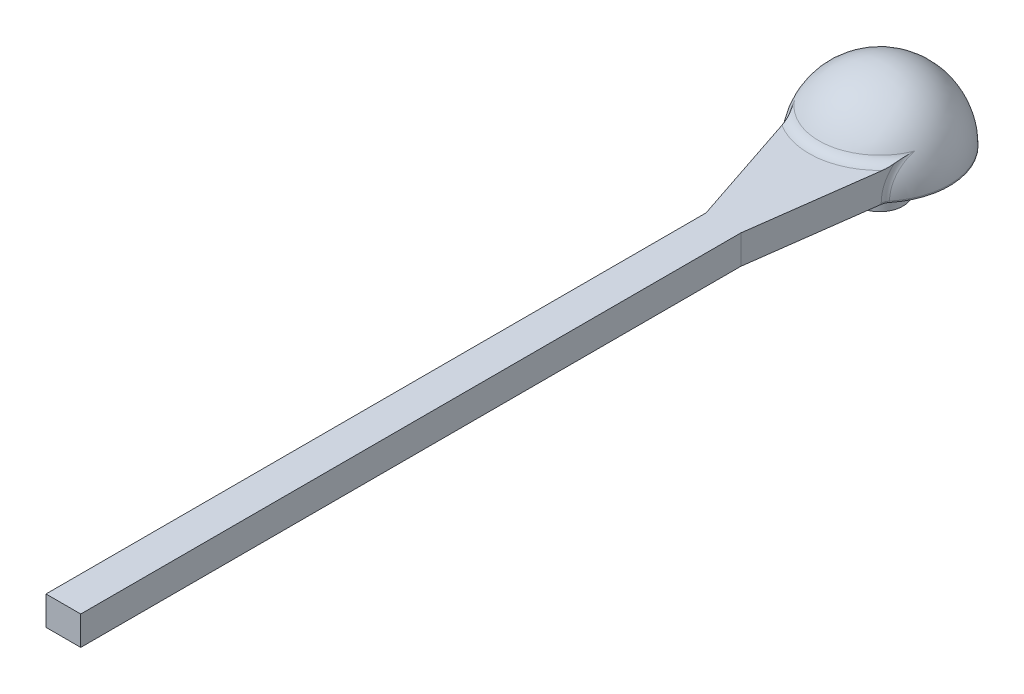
ISO-10303-21;
HEADER;
FILE_DESCRIPTION(('STEP AP214'),'2;1');
FILE_NAME('part.step','',(''),(''),'','','');
FILE_SCHEMA(('AUTOMOTIVE_DESIGN { 1 0 10303 214 1 1 1 1 }'));
ENDSEC;
DATA;
#1=APPLICATION_CONTEXT('core data for automotive mechanical design processes');
#2=APPLICATION_PROTOCOL_DEFINITION('international standard','automotive_design',2000,#1);
#3=PRODUCT_CONTEXT('',#1,'mechanical');
#4=PRODUCT('Part','Part','',(#3));
#5=PRODUCT_RELATED_PRODUCT_CATEGORY('part','',(#4));
#6=PRODUCT_DEFINITION_FORMATION('','',#4);
#7=PRODUCT_DEFINITION_CONTEXT('part definition',#1,'design');
#8=PRODUCT_DEFINITION('design','',#6,#7);
#9=PRODUCT_DEFINITION_SHAPE('','',#8);
#10=(LENGTH_UNIT() NAMED_UNIT(*) SI_UNIT(.MILLI.,.METRE.));
#11=(NAMED_UNIT(*) PLANE_ANGLE_UNIT() SI_UNIT($,.RADIAN.));
#12=(NAMED_UNIT(*) SI_UNIT($,.STERADIAN.) SOLID_ANGLE_UNIT());
#13=UNCERTAINTY_MEASURE_WITH_UNIT(LENGTH_MEASURE(1.E-05),#10,'distance_accuracy_value','');
#14=(GEOMETRIC_REPRESENTATION_CONTEXT(3) GLOBAL_UNCERTAINTY_ASSIGNED_CONTEXT((#13)) GLOBAL_UNIT_ASSIGNED_CONTEXT((#10,
#11,#12)) REPRESENTATION_CONTEXT('',''));
#15=CARTESIAN_POINT('',(0.,0.,0.));
#16=DIRECTION('',(0.,0.,1.));
#17=DIRECTION('',(1.,0.,0.));
#18=AXIS2_PLACEMENT_3D('',#15,#16,#17);
#19=CARTESIAN_POINT('',(0.,3.6,0.));
#20=DIRECTION('',(0.,-1.,0.));
#21=DIRECTION('',(0.,0.,-1.));
#22=AXIS2_PLACEMENT_3D('',#19,#20,#21);
#23=CYLINDRICAL_SURFACE('',#22,6.);
#24=CARTESIAN_POINT('',(0.,3.5,0.));
#25=DIRECTION('',(0.,1.,0.));
#26=DIRECTION('',(0.,0.,1.));
#27=AXIS2_PLACEMENT_3D('',#24,#25,#26);
#28=CIRCLE('',#27,6.);
#29=CARTESIAN_POINT('',(4.64387353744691,3.5,3.79926816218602));
#30=VERTEX_POINT('',#29);
#31=CARTESIAN_POINT('',(-3.58564445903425,3.5,4.81073318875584));
#32=VERTEX_POINT('',#31);
#33=EDGE_CURVE('E217',#30,#32,#28,.T.);
#34=ORIENTED_EDGE('',*,*,#33,.T.);
#35=DIRECTION('',(0.,-1.,0.));
#36=VECTOR('',#35,1.);
#37=CARTESIAN_POINT('',(-3.58564445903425,3.6,4.81073318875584));
#38=LINE('',#37,#36);
#39=CARTESIAN_POINT('',(-3.58564445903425,3.6,4.81073318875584));
#40=VERTEX_POINT('',#39);
#41=EDGE_CURVE('E236',#32,#40,#38,.F.);
#42=ORIENTED_EDGE('',*,*,#41,.T.);
#43=CARTESIAN_POINT('',(0.,3.6,0.));
#44=DIRECTION('',(0.,1.,0.));
#45=DIRECTION('',(0.,0.,1.));
#46=AXIS2_PLACEMENT_3D('',#43,#44,#45);
#47=CIRCLE('',#46,6.);
#48=CARTESIAN_POINT('',(4.64387353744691,3.6,3.79926816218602));
#49=VERTEX_POINT('',#48);
#50=EDGE_CURVE('E220',#49,#40,#47,.T.);
#51=ORIENTED_EDGE('',*,*,#50,.F.);
#52=DIRECTION('',(0.,-1.,0.));
#53=VECTOR('',#52,1.);
#54=CARTESIAN_POINT('',(4.64387353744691,3.6,3.79926816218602));
#55=LINE('',#54,#53);
#56=EDGE_CURVE('E234',#49,#30,#55,.T.);
#57=ORIENTED_EDGE('',*,*,#56,.T.);
#58=EDGE_LOOP('',(#34,#42,#51,#57));
#59=FACE_BOUND('',#58,.T.);
#60=ADVANCED_FACE('F35',(#59),#23,.T.);
#61=CARTESIAN_POINT('',(0.,3.6,0.));
#62=DIRECTION('',(0.,0.,1.));
#63=DIRECTION('',(1.,0.,0.));
#64=AXIS2_PLACEMENT_3D('',#61,#62,#63);
#65=SPHERICAL_SURFACE('',#64,6.);
#66=ORIENTED_EDGE('',*,*,#50,.T.);
#67=CARTESIAN_POINT('',(-4.67029996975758,3.6,1.55676665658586));
#68=DIRECTION('',(0.948683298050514,0.,-0.316227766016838));
#69=DIRECTION('',(-0.316227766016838,0.,-0.948683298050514));
#70=AXIS2_PLACEMENT_3D('',#67,#68,#69);
#71=CIRCLE('',#70,3.4299818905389);
#72=CARTESIAN_POINT('',(-4.09831093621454,6.51428571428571,3.27273375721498));
#73=VERTEX_POINT('',#72);
#74=EDGE_CURVE('E245',#40,#73,#71,.F.);
#75=ORIENTED_EDGE('',*,*,#74,.T.);
#76=CARTESIAN_POINT('',(0.,6.51428571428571,0.));
#77=DIRECTION('',(0.,-1.,0.));
#78=DIRECTION('',(0.,0.,-1.));
#79=AXIS2_PLACEMENT_3D('',#76,#77,#78);
#80=CIRCLE('',#79,5.24470578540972);
#81=CARTESIAN_POINT('',(4.90170409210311,6.51428571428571,1.86553900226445));
#82=VERTEX_POINT('',#81);
#83=EDGE_CURVE('E241',#73,#82,#80,.F.);
#84=ORIENTED_EDGE('',*,*,#83,.T.);
#85=CARTESIAN_POINT('',(5.0604785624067,3.6,0.674730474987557));
#86=DIRECTION('',(-0.991227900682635,0.,-0.132163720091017));
#87=DIRECTION('',(-0.132163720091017,0.,0.991227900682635));
#88=AXIS2_PLACEMENT_3D('',#85,#86,#87);
#89=CIRCLE('',#88,3.15218900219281);
#90=EDGE_CURVE('E243',#82,#49,#89,.F.);
#91=ORIENTED_EDGE('',*,*,#90,.T.);
#92=EDGE_LOOP('',(#66,#75,#84,#91));
#93=FACE_BOUND('',#92,.T.);
#94=ADVANCED_FACE('F304',(#93),#65,.T.);
#95=CARTESIAN_POINT('',(0.,3.5,0.));
#96=DIRECTION('',(0.,-1.,0.));
#97=DIRECTION('',(0.,0.,-1.));
#98=AXIS2_PLACEMENT_3D('',#95,#96,#97);
#99=CYLINDRICAL_SURFACE('',#98,2.);
#100=CARTESIAN_POINT('',(0.,3.5,0.));
#101=DIRECTION('',(0.,1.,0.));
#102=DIRECTION('',(0.,0.,1.));
#103=AXIS2_PLACEMENT_3D('',#100,#101,#102);
#104=CIRCLE('',#103,2.);
#105=CARTESIAN_POINT('',(0.,3.5,2.));
#106=VERTEX_POINT('',#105);
#107=EDGE_CURVE('E221',#106,#106,#104,.T.);
#108=ORIENTED_EDGE('',*,*,#107,.F.);
#109=EDGE_LOOP('',(#108));
#110=FACE_BOUND('',#109,.T.);
#111=CARTESIAN_POINT('',(0.,0.,0.));
#112=DIRECTION('',(0.,1.,0.));
#113=DIRECTION('',(0.,0.,1.));
#114=AXIS2_PLACEMENT_3D('',#111,#112,#113);
#115=CIRCLE('',#114,2.);
#116=CARTESIAN_POINT('',(0.,0.,2.));
#117=VERTEX_POINT('',#116);
#118=EDGE_CURVE('E225',#117,#117,#115,.T.);
#119=ORIENTED_EDGE('',*,*,#118,.T.);
#120=EDGE_LOOP('',(#119));
#121=FACE_BOUND('',#120,.T.);
#122=ADVANCED_FACE('F339',(#110,#121),#99,.T.);
#123=CARTESIAN_POINT('',(0.,0.,0.));
#124=DIRECTION('',(0.,1.,0.));
#125=DIRECTION('',(0.,0.,1.));
#126=AXIS2_PLACEMENT_3D('',#123,#124,#125);
#127=PLANE('',#126);
#128=DIRECTION('',(0.,0.,1.));
#129=VECTOR('',#128,1.);
#130=CARTESIAN_POINT('',(0.707106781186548,0.,-0.707106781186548));
#131=LINE('',#130,#129);
#132=CARTESIAN_POINT('',(0.707106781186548,0.,-0.707106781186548));
#133=VERTEX_POINT('',#132);
#134=CARTESIAN_POINT('',(0.707106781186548,0.,0.707106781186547));
#135=VERTEX_POINT('',#134);
#136=EDGE_CURVE('E171',#133,#135,#131,.T.);
#137=ORIENTED_EDGE('',*,*,#136,.F.);
#138=DIRECTION('',(1.,0.,0.));
#139=VECTOR('',#138,1.);
#140=CARTESIAN_POINT('',(-0.707106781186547,0.,-0.707106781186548));
#141=LINE('',#140,#139);
#142=CARTESIAN_POINT('',(-0.707106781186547,0.,-0.707106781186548));
#143=VERTEX_POINT('',#142);
#144=EDGE_CURVE('E52',#143,#133,#141,.T.);
#145=ORIENTED_EDGE('',*,*,#144,.F.);
#146=DIRECTION('',(0.,0.,1.));
#147=VECTOR('',#146,1.);
#148=CARTESIAN_POINT('',(-0.707106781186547,0.,-0.707106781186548));
#149=LINE('',#148,#147);
#150=CARTESIAN_POINT('',(-0.707106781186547,0.,0.707106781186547));
#151=VERTEX_POINT('',#150);
#152=EDGE_CURVE('E162',#143,#151,#149,.T.);
#153=ORIENTED_EDGE('',*,*,#152,.T.);
#154=DIRECTION('',(1.,0.,0.));
#155=VECTOR('',#154,1.);
#156=CARTESIAN_POINT('',(-0.707106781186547,0.,0.707106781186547));
#157=LINE('',#156,#155);
#158=EDGE_CURVE('E165',#151,#135,#157,.T.);
#159=ORIENTED_EDGE('',*,*,#158,.T.);
#160=EDGE_LOOP('',(#137,#145,#153,#159));
#161=FACE_BOUND('',#160,.T.);
#162=ORIENTED_EDGE('',*,*,#118,.F.);
#163=EDGE_LOOP('',(#162));
#164=FACE_BOUND('',#163,.T.);
#165=ADVANCED_FACE('F344',(#161,#164),#127,.F.);
#166=CARTESIAN_POINT('',(0.,3.5,0.));
#167=DIRECTION('',(0.,1.,0.));
#168=DIRECTION('',(0.,0.,1.));
#169=AXIS2_PLACEMENT_3D('',#166,#167,#168);
#170=PLANE('',#169);
#171=ORIENTED_EDGE('',*,*,#33,.F.);
#172=CARTESIAN_POINT('',(5.41785246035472,3.5,4.43247952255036));
#173=DIRECTION('',(0.,1.,0.));
#174=DIRECTION('',(0.,0.,1.));
#175=AXIS2_PLACEMENT_3D('',#172,#173,#174);
#176=CIRCLE('',#175,1.);
#177=CARTESIAN_POINT('',(4.42662455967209,3.5,4.30031580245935));
#178=VERTEX_POINT('',#177);
#179=EDGE_CURVE('E251',#30,#178,#176,.T.);
#180=ORIENTED_EDGE('',*,*,#179,.T.);
#181=DIRECTION('',(0.132163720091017,0.,-0.991227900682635));
#182=VECTOR('',#181,1.);
#183=CARTESIAN_POINT('',(3.00000000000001,3.5,15.));
#184=LINE('',#183,#182);
#185=CARTESIAN_POINT('',(3.00000000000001,3.5,15.));
#186=VERTEX_POINT('',#185);
#187=EDGE_CURVE('E202',#186,#178,#184,.T.);
#188=ORIENTED_EDGE('',*,*,#187,.F.);
#189=DIRECTION('',(0.,0.,-1.));
#190=VECTOR('',#189,1.);
#191=CARTESIAN_POINT('',(3.,3.5,72.));
#192=LINE('',#191,#190);
#193=CARTESIAN_POINT('',(3.,3.5,72.));
#194=VERTEX_POINT('',#193);
#195=EDGE_CURVE('E200',#194,#186,#192,.T.);
#196=ORIENTED_EDGE('',*,*,#195,.F.);
#197=DIRECTION('',(1.,0.,0.));
#198=VECTOR('',#197,1.);
#199=CARTESIAN_POINT('',(0.,3.5,72.));
#200=LINE('',#199,#198);
#201=CARTESIAN_POINT('',(0.,3.5,72.));
#202=VERTEX_POINT('',#201);
#203=EDGE_CURVE('E198',#202,#194,#200,.T.);
#204=ORIENTED_EDGE('',*,*,#203,.F.);
#205=DIRECTION('',(0.,0.,1.));
#206=VECTOR('',#205,1.);
#207=CARTESIAN_POINT('',(0.,3.5,15.));
#208=LINE('',#207,#206);
#209=CARTESIAN_POINT('',(0.,3.5,15.));
#210=VERTEX_POINT('',#209);
#211=EDGE_CURVE('E195',#210,#202,#208,.T.);
#212=ORIENTED_EDGE('',*,*,#211,.F.);
#213=DIRECTION('',(0.316227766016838,0.,0.948683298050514));
#214=VECTOR('',#213,1.);
#215=CARTESIAN_POINT('',(-5.,3.5,0.));
#216=LINE('',#215,#214);
#217=CARTESIAN_POINT('',(-3.23456857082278,3.5,5.29629428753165));
#218=VERTEX_POINT('',#217);
#219=EDGE_CURVE('E185',#218,#210,#216,.T.);
#220=ORIENTED_EDGE('',*,*,#219,.F.);
#221=CARTESIAN_POINT('',(-4.1832518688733,3.5,5.61252205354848));
#222=DIRECTION('',(0.,1.,0.));
#223=DIRECTION('',(0.,0.,1.));
#224=AXIS2_PLACEMENT_3D('',#221,#222,#223);
#225=CIRCLE('',#224,1.);
#226=EDGE_CURVE('E249',#218,#32,#225,.T.);
#227=ORIENTED_EDGE('',*,*,#226,.T.);
#228=EDGE_LOOP('',(#171,#180,#188,#196,#204,#212,#220,#227));
#229=FACE_BOUND('',#228,.T.);
#230=ORIENTED_EDGE('',*,*,#107,.T.);
#231=EDGE_LOOP('',(#230));
#232=FACE_BOUND('',#231,.T.);
#233=ADVANCED_FACE('F326',(#229,#232),#170,.F.);
#234=CARTESIAN_POINT('',(3.00000000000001,6.,15.));
#235=DIRECTION('',(-0.991227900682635,0.,-0.132163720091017));
#236=DIRECTION('',(-0.132163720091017,0.,0.991227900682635));
#237=AXIS2_PLACEMENT_3D('',#234,#235,#236);
#238=PLANE('',#237);
#239=ORIENTED_EDGE('',*,*,#187,.T.);
#240=DIRECTION('',(0.,1.,0.));
#241=VECTOR('',#240,1.);
#242=CARTESIAN_POINT('',(4.42662455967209,3.6,4.30031580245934));
#243=LINE('',#242,#241);
#244=CARTESIAN_POINT('',(4.42662455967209,3.6,4.30031580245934));
#245=VERTEX_POINT('',#244);
#246=EDGE_CURVE('E239',#178,#245,#243,.T.);
#247=ORIENTED_EDGE('',*,*,#246,.T.);
#248=CARTESIAN_POINT('',(4.91266375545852,3.6,0.655021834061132));
#249=DIRECTION('',(-0.991227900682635,0.,-0.132163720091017));
#250=DIRECTION('',(-0.132163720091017,0.,0.991227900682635));
#251=AXIS2_PLACEMENT_3D('',#248,#249,#250);
#252=CIRCLE('',#251,3.67755383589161);
#253=CARTESIAN_POINT('',(4.5596056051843,6.12748618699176,3.30295796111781));
#254=VERTEX_POINT('',#253);
#255=EDGE_CURVE('E59',#245,#254,#252,.T.);
#256=ORIENTED_EDGE('',*,*,#255,.T.);
#257=CARTESIAN_POINT('',(4.5596056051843,6.12748618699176,3.30295796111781));
#258=CARTESIAN_POINT('',(4.5497094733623,6.10761185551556,3.37717894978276));
#259=CARTESIAN_POINT('',(4.53973994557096,6.08975143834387,3.45195040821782));
#260=CARTESIAN_POINT('',(4.51972151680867,6.05854681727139,3.60208862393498));
#261=CARTESIAN_POINT('',(4.50967311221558,6.04518430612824,3.67745165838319));
#262=CARTESIAN_POINT('',(4.48947068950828,6.02328054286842,3.82896982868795));
#263=CARTESIAN_POINT('',(4.47931656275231,6.01474488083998,3.90512577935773));
#264=CARTESIAN_POINT('',(4.45891262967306,6.00310465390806,4.05815527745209));
#265=CARTESIAN_POINT('',(4.44866260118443,6.00002276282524,4.13503049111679));
#266=CARTESIAN_POINT('',(4.43840623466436,6.,4.21195324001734));
#267=B_SPLINE_CURVE_WITH_KNOTS('',3,(#257,#258,#259,#260,#261,#262,#263,#264,#265,#266),
.UNSPECIFIED.,.F.,.F.,(4,2,2,2,4),(0.,0.232411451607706,0.4638651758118,0.695586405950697,
0.92826876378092),.UNSPECIFIED.);
#268=CARTESIAN_POINT('',(4.43840623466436,6.,4.21195324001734));
#269=VERTEX_POINT('',#268);
#270=EDGE_CURVE('E11',#254,#269,#267,.T.);
#271=ORIENTED_EDGE('',*,*,#270,.T.);
#272=DIRECTION('',(0.132163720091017,0.,-0.991227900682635));
#273=VECTOR('',#272,1.);
#274=CARTESIAN_POINT('',(3.00000000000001,6.,15.));
#275=LINE('',#274,#273);
#276=CARTESIAN_POINT('',(3.00000000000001,6.,15.));
#277=VERTEX_POINT('',#276);
#278=EDGE_CURVE('E189',#277,#269,#275,.T.);
#279=ORIENTED_EDGE('',*,*,#278,.F.);
#280=DIRECTION('',(0.,-1.,0.));
#281=VECTOR('',#280,1.);
#282=CARTESIAN_POINT('',(3.00000000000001,6.,15.));
#283=LINE('',#282,#281);
#284=EDGE_CURVE('E208',#277,#186,#283,.T.);
#285=ORIENTED_EDGE('',*,*,#284,.T.);
#286=EDGE_LOOP('',(#239,#247,#256,#271,#279,#285));
#287=FACE_BOUND('',#286,.T.);
#288=ADVANCED_FACE('F319',(#287),#238,.F.);
#289=CARTESIAN_POINT('',(-5.,6.,0.));
#290=DIRECTION('',(0.948683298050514,0.,-0.316227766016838));
#291=DIRECTION('',(-0.316227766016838,0.,-0.948683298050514));
#292=AXIS2_PLACEMENT_3D('',#289,#290,#291);
#293=PLANE('',#292);
#294=CARTESIAN_POINT('',(-4.5,3.6,1.5));
#295=DIRECTION('',(0.948683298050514,0.,-0.316227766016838));
#296=DIRECTION('',(-0.316227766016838,0.,-0.948683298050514));
#297=AXIS2_PLACEMENT_3D('',#294,#295,#296);
#298=CIRCLE('',#297,4.00164553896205);
#299=CARTESIAN_POINT('',(-3.51236220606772,6.10177594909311,4.46291338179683));
#300=VERTEX_POINT('',#299);
#301=CARTESIAN_POINT('',(-3.23456857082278,3.6,5.29629428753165));
#302=VERTEX_POINT('',#301);
#303=EDGE_CURVE('E224',#300,#302,#298,.T.);
#304=ORIENTED_EDGE('',*,*,#303,.T.);
#305=DIRECTION('',(0.,1.,0.));
#306=VECTOR('',#305,1.);
#307=CARTESIAN_POINT('',(-3.23456857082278,3.5,5.29629428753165));
#308=LINE('',#307,#306);
#309=EDGE_CURVE('E231',#302,#218,#308,.F.);
#310=ORIENTED_EDGE('',*,*,#309,.T.);
#311=ORIENTED_EDGE('',*,*,#219,.T.);
#312=DIRECTION('',(0.,-1.,0.));
#313=VECTOR('',#312,1.);
#314=CARTESIAN_POINT('',(0.,6.,15.));
#315=LINE('',#314,#313);
#316=CARTESIAN_POINT('',(0.,6.,15.));
#317=VERTEX_POINT('',#316);
#318=EDGE_CURVE('E194',#317,#210,#315,.T.);
#319=ORIENTED_EDGE('',*,*,#318,.F.);
#320=DIRECTION('',(0.316227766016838,0.,0.948683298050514));
#321=VECTOR('',#320,1.);
#322=CARTESIAN_POINT('',(-5.,6.,0.));
#323=LINE('',#322,#321);
#324=CARTESIAN_POINT('',(-3.2777070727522,6.,5.16687878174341));
#325=VERTEX_POINT('',#324);
#326=EDGE_CURVE('E192',#325,#317,#323,.T.);
#327=ORIENTED_EDGE('',*,*,#326,.F.);
#328=CARTESIAN_POINT('',(-3.2777070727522,6.,5.16687878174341));
#329=CARTESIAN_POINT('',(-3.29755514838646,6.00001218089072,5.10733455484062));
#330=CARTESIAN_POINT('',(-3.31739560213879,6.00235708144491,5.04781319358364));
#331=CARTESIAN_POINT('',(-3.35689454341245,6.0113706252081,4.92931636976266));
#332=CARTESIAN_POINT('',(-3.37655344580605,6.01802088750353,4.87033966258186));
#333=CARTESIAN_POINT('',(-3.41567775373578,6.03530265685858,4.75296673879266));
#334=CARTESIAN_POINT('',(-3.43514329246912,6.04593119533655,4.69457012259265));
#335=CARTESIAN_POINT('',(-3.47391268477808,6.07102019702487,4.57826194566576));
#336=CARTESIAN_POINT('',(-3.4932154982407,6.08549676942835,4.52035350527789));
#337=CARTESIAN_POINT('',(-3.51236220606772,6.10177594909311,4.46291338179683));
#338=B_SPLINE_CURVE_WITH_KNOTS('',3,(#328,#329,#330,#331,#332,#333,#334,#335,#336,#337),
.UNSPECIFIED.,.F.,.F.,(4,2,2,2,4),(0.,0.188217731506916,0.375637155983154,0.562917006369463,
0.750993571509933),.UNSPECIFIED.);
#339=EDGE_CURVE('E44',#325,#300,#338,.T.);
#340=ORIENTED_EDGE('',*,*,#339,.T.);
#341=EDGE_LOOP('',(#304,#310,#311,#319,#327,#340));
#342=FACE_BOUND('',#341,.T.);
#343=ADVANCED_FACE('F264',(#342),#293,.F.);
#344=CARTESIAN_POINT('',(0.,6.,15.));
#345=DIRECTION('',(1.,0.,0.));
#346=DIRECTION('',(0.,0.,-1.));
#347=AXIS2_PLACEMENT_3D('',#344,#345,#346);
#348=PLANE('',#347);
#349=ORIENTED_EDGE('',*,*,#211,.T.);
#350=DIRECTION('',(0.,-1.,0.));
#351=VECTOR('',#350,1.);
#352=CARTESIAN_POINT('',(0.,6.,72.));
#353=LINE('',#352,#351);
#354=CARTESIAN_POINT('',(0.,6.,72.));
#355=VERTEX_POINT('',#354);
#356=EDGE_CURVE('E214',#355,#202,#353,.T.);
#357=ORIENTED_EDGE('',*,*,#356,.F.);
#358=DIRECTION('',(0.,0.,1.));
#359=VECTOR('',#358,1.);
#360=CARTESIAN_POINT('',(0.,6.,15.));
#361=LINE('',#360,#359);
#362=EDGE_CURVE('E181',#317,#355,#361,.T.);
#363=ORIENTED_EDGE('',*,*,#362,.F.);
#364=ORIENTED_EDGE('',*,*,#318,.T.);
#365=EDGE_LOOP('',(#349,#357,#363,#364));
#366=FACE_BOUND('',#365,.T.);
#367=ADVANCED_FACE('F393',(#366),#348,.F.);
#368=CARTESIAN_POINT('',(0.,6.,72.));
#369=DIRECTION('',(0.,0.,-1.));
#370=DIRECTION('',(-1.,0.,0.));
#371=AXIS2_PLACEMENT_3D('',#368,#369,#370);
#372=PLANE('',#371);
#373=ORIENTED_EDGE('',*,*,#203,.T.);
#374=DIRECTION('',(0.,-1.,0.));
#375=VECTOR('',#374,1.);
#376=CARTESIAN_POINT('',(3.,6.,72.));
#377=LINE('',#376,#375);
#378=CARTESIAN_POINT('',(3.,6.,72.));
#379=VERTEX_POINT('',#378);
#380=EDGE_CURVE('E211',#379,#194,#377,.T.);
#381=ORIENTED_EDGE('',*,*,#380,.F.);
#382=DIRECTION('',(1.,0.,0.));
#383=VECTOR('',#382,1.);
#384=CARTESIAN_POINT('',(0.,6.,72.));
#385=LINE('',#384,#383);
#386=EDGE_CURVE('E184',#355,#379,#385,.T.);
#387=ORIENTED_EDGE('',*,*,#386,.F.);
#388=ORIENTED_EDGE('',*,*,#356,.T.);
#389=EDGE_LOOP('',(#373,#381,#387,#388));
#390=FACE_BOUND('',#389,.T.);
#391=ADVANCED_FACE('F386',(#390),#372,.F.);
#392=CARTESIAN_POINT('',(3.,6.,72.));
#393=DIRECTION('',(-1.,0.,0.));
#394=DIRECTION('',(0.,0.,1.));
#395=AXIS2_PLACEMENT_3D('',#392,#393,#394);
#396=PLANE('',#395);
#397=ORIENTED_EDGE('',*,*,#195,.T.);
#398=ORIENTED_EDGE('',*,*,#284,.F.);
#399=DIRECTION('',(0.,0.,-1.));
#400=VECTOR('',#399,1.);
#401=CARTESIAN_POINT('',(3.,6.,72.));
#402=LINE('',#401,#400);
#403=EDGE_CURVE('E187',#379,#277,#402,.T.);
#404=ORIENTED_EDGE('',*,*,#403,.F.);
#405=ORIENTED_EDGE('',*,*,#380,.T.);
#406=EDGE_LOOP('',(#397,#398,#404,#405));
#407=FACE_BOUND('',#406,.T.);
#408=ADVANCED_FACE('F379',(#407),#396,.F.);
#409=CARTESIAN_POINT('',(0.,6.,0.));
#410=DIRECTION('',(0.,1.,0.));
#411=DIRECTION('',(0.,0.,1.));
#412=AXIS2_PLACEMENT_3D('',#409,#410,#411);
#413=PLANE('',#412);
#414=ORIENTED_EDGE('',*,*,#278,.T.);
#415=CARTESIAN_POINT('',(0.,6.,0.));
#416=DIRECTION('',(0.,1.,0.));
#417=DIRECTION('',(0.,0.,1.));
#418=AXIS2_PLACEMENT_3D('',#415,#416,#417);
#419=CIRCLE('',#418,6.11882341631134);
#420=EDGE_CURVE('E247',#269,#325,#419,.F.);
#421=ORIENTED_EDGE('',*,*,#420,.T.);
#422=ORIENTED_EDGE('',*,*,#326,.T.);
#423=ORIENTED_EDGE('',*,*,#362,.T.);
#424=ORIENTED_EDGE('',*,*,#386,.T.);
#425=ORIENTED_EDGE('',*,*,#403,.T.);
#426=EDGE_LOOP('',(#414,#421,#422,#423,#424,#425));
#427=FACE_BOUND('',#426,.T.);
#428=ADVANCED_FACE('F314',(#427),#413,.T.);
#429=CARTESIAN_POINT('',(5.41785246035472,3.6,4.43247952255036));
#430=DIRECTION('',(0.,-1.,0.));
#431=DIRECTION('',(0.,0.,-1.));
#432=AXIS2_PLACEMENT_3D('',#429,#430,#431);
#433=CYLINDRICAL_SURFACE('',#432,1.);
#434=ORIENTED_EDGE('',*,*,#179,.F.);
#435=ORIENTED_EDGE('',*,*,#56,.F.);
#436=CARTESIAN_POINT('',(5.41785246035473,3.6,4.43247952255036));
#437=DIRECTION('',(0.,-1.,0.));
#438=DIRECTION('',(0.,0.,-1.));
#439=AXIS2_PLACEMENT_3D('',#436,#437,#438);
#440=CIRCLE('',#439,1.);
#441=EDGE_CURVE('E39',#245,#49,#440,.T.);
#442=ORIENTED_EDGE('',*,*,#441,.F.);
#443=ORIENTED_EDGE('',*,*,#246,.F.);
#444=EDGE_LOOP('',(#434,#435,#442,#443));
#445=FACE_BOUND('',#444,.T.);
#446=ADVANCED_FACE('F37',(#445),#433,.F.);
#447=CARTESIAN_POINT('',(5.90389165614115,3.6,0.787185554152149));
#448=DIRECTION('',(-0.991227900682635,0.,-0.132163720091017));
#449=DIRECTION('',(-0.132163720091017,0.,0.991227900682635));
#450=AXIS2_PLACEMENT_3D('',#447,#448,#449);
#451=TOROIDAL_SURFACE('',#450,3.67755383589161,1.);
#452=ORIENTED_EDGE('',*,*,#441,.T.);
#453=ORIENTED_EDGE('',*,*,#90,.F.);
#454=CARTESIAN_POINT('',(4.5596056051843,6.12748618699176,3.30295796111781));
#455=CARTESIAN_POINT('',(4.56540959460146,6.13914063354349,3.25951047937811));
#456=CARTESIAN_POINT('',(4.57202436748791,6.1510887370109,3.21626296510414));
#457=CARTESIAN_POINT('',(4.58658661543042,6.1753561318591,3.13011458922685));
#458=CARTESIAN_POINT('',(4.59453356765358,6.18767527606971,3.0872135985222));
#459=CARTESIAN_POINT('',(4.61146901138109,6.21246741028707,3.00170788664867));
#460=CARTESIAN_POINT('',(4.62045660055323,6.22494025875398,2.9591029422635));
#461=CARTESIAN_POINT('',(4.63925850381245,6.24989124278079,2.87407330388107));
#462=CARTESIAN_POINT('',(4.6490729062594,6.26236937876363,2.83164862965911));
#463=CARTESIAN_POINT('',(4.67945274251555,6.2995890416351,2.70456905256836));
#464=CARTESIAN_POINT('',(4.70096073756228,6.32412430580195,2.62008011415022));
#465=CARTESIAN_POINT('',(4.74523560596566,6.37174954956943,2.45101652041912));
#466=CARTESIAN_POINT('',(4.76800261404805,6.39483937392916,2.36644185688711));
#467=CARTESIAN_POINT('',(4.8054890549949,6.43087537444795,2.22757131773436));
#468=CARTESIAN_POINT('',(4.8201316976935,6.44446267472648,2.17342149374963));
#469=CARTESIAN_POINT('',(4.84929511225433,6.47059834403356,2.06484504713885));
#470=CARTESIAN_POINT('',(4.86381589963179,6.48314684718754,2.01041846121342));
#471=CARTESIAN_POINT('',(4.88533599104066,6.50106769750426,1.92857609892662));
#472=CARTESIAN_POINT('',(4.89245857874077,6.50688542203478,1.90129000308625));
#473=CARTESIAN_POINT('',(4.90025420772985,6.51312823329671,1.87115218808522));
#474=CARTESIAN_POINT('',(4.90097943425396,6.513707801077,1.86834583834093));
#475=CARTESIAN_POINT('',(4.90170409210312,6.51428571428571,1.86553900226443));
#476=B_SPLINE_CURVE_WITH_KNOTS('',3,(#454,#455,#456,#457,#458,#459,#460,#461,#462,#463,#464,
#465,#466,#467,#468,#469,#470,#471,#472,#473,#474,#475),.UNSPECIFIED.,.F.,.F.,(4,2,2,2,2,2,2,2,
2,2,4),(0.,0.13604271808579,0.272032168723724,0.407904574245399,0.543791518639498,
0.815474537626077,1.08718668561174,1.26032906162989,1.4334490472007,1.51982982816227,
1.52869758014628),.UNSPECIFIED.);
#477=EDGE_CURVE('E285',#254,#82,#476,.T.);
#478=ORIENTED_EDGE('',*,*,#477,.F.);
#479=ORIENTED_EDGE('',*,*,#255,.F.);
#480=EDGE_LOOP('',(#452,#453,#478,#479));
#481=FACE_BOUND('',#480,.T.);
#482=ADVANCED_FACE('F272',(#481),#451,.F.);
#483=CARTESIAN_POINT('',(0.,7.,0.));
#484=DIRECTION('',(0.,1.,0.));
#485=DIRECTION('',(0.,0.,1.));
#486=AXIS2_PLACEMENT_3D('',#483,#484,#485);
#487=TOROIDAL_SURFACE('',#486,6.11882341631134,1.);
#488=ORIENTED_EDGE('',*,*,#477,.T.);
#489=ORIENTED_EDGE('',*,*,#83,.F.);
#490=CARTESIAN_POINT('',(-3.51236220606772,6.10177594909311,4.46291338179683));
#491=CARTESIAN_POINT('',(-3.53007098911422,6.11684512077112,4.40989896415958));
#492=CARTESIAN_POINT('',(-3.54929032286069,6.13273888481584,4.35767693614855));
#493=CARTESIAN_POINT('',(-3.5901069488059,6.1656424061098,4.25459429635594));
#494=CARTESIAN_POINT('',(-3.61170159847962,6.18265091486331,4.20373224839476));
#495=CARTESIAN_POINT('',(-3.65661698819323,6.21724732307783,4.10314368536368));
#496=CARTESIAN_POINT('',(-3.6799337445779,6.2348338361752,4.05341487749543));
#497=CARTESIAN_POINT('',(-3.72792290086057,6.27027918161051,3.9546969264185));
#498=CARTESIAN_POINT('',(-3.7525957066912,6.2881380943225,3.90570801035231));
#499=CARTESIAN_POINT('',(-3.82799161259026,6.34159191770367,3.75971873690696));
#500=CARTESIAN_POINT('',(-3.88019585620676,6.37714394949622,3.66347344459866));
#501=CARTESIAN_POINT('',(-3.98648028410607,6.44639568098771,3.47132322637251));
#502=CARTESIAN_POINT('',(-4.04056096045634,6.48009488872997,3.37541839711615));
#503=CARTESIAN_POINT('',(-4.09594479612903,6.51288714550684,3.27694133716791));
#504=CARTESIAN_POINT('',(-4.09712784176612,6.51358681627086,3.27483766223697));
#505=CARTESIAN_POINT('',(-4.09831093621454,6.51428571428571,3.27273375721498));
#506=B_SPLINE_CURVE_WITH_KNOTS('',3,(#490,#491,#492,#493,#494,#495,#496,#497,#498,#499,#500,
#501,#502,#503,#504,#505),.UNSPECIFIED.,.F.,.F.,(4,2,2,2,2,2,2,4),(0.,0.173568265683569,
0.346945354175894,0.519933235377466,0.692973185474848,1.03827946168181,1.38367698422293,
1.39121563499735),.UNSPECIFIED.);
#507=EDGE_CURVE('E280',#300,#73,#506,.T.);
#508=ORIENTED_EDGE('',*,*,#507,.F.);
#509=ORIENTED_EDGE('',*,*,#339,.F.);
#510=ORIENTED_EDGE('',*,*,#420,.F.);
#511=ORIENTED_EDGE('',*,*,#270,.F.);
#512=EDGE_LOOP('',(#488,#489,#508,#509,#510,#511));
#513=FACE_BOUND('',#512,.T.);
#514=ADVANCED_FACE('F267',(#513),#487,.F.);
#515=CARTESIAN_POINT('',(-5.44868329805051,3.6,1.81622776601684));
#516=DIRECTION('',(0.948683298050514,0.,-0.316227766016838));
#517=DIRECTION('',(-0.316227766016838,0.,-0.948683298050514));
#518=AXIS2_PLACEMENT_3D('',#515,#516,#517);
#519=TOROIDAL_SURFACE('',#518,4.00164553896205,1.);
#520=ORIENTED_EDGE('',*,*,#507,.T.);
#521=ORIENTED_EDGE('',*,*,#74,.F.);
#522=CARTESIAN_POINT('',(-4.1832518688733,3.6,5.61252205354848));
#523=DIRECTION('',(0.,1.,0.));
#524=DIRECTION('',(0.,0.,1.));
#525=AXIS2_PLACEMENT_3D('',#522,#523,#524);
#526=CIRCLE('',#525,1.);
#527=EDGE_CURVE('E177',#302,#40,#526,.T.);
#528=ORIENTED_EDGE('',*,*,#527,.F.);
#529=ORIENTED_EDGE('',*,*,#303,.F.);
#530=EDGE_LOOP('',(#520,#521,#528,#529));
#531=FACE_BOUND('',#530,.T.);
#532=ADVANCED_FACE('F271',(#531),#519,.F.);
#533=CARTESIAN_POINT('',(-4.1832518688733,3.6,5.61252205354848));
#534=DIRECTION('',(0.,-1.,0.));
#535=DIRECTION('',(0.,0.,-1.));
#536=AXIS2_PLACEMENT_3D('',#533,#534,#535);
#537=CYLINDRICAL_SURFACE('',#536,1.);
#538=ORIENTED_EDGE('',*,*,#527,.T.);
#539=ORIENTED_EDGE('',*,*,#41,.F.);
#540=ORIENTED_EDGE('',*,*,#226,.F.);
#541=ORIENTED_EDGE('',*,*,#309,.F.);
#542=EDGE_LOOP('',(#538,#539,#540,#541));
#543=FACE_BOUND('',#542,.T.);
#544=ADVANCED_FACE('F302',(#543),#537,.F.);
#545=CARTESIAN_POINT('',(-0.707106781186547,3.5,-0.707106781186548));
#546=DIRECTION('',(0.,0.,-1.));
#547=DIRECTION('',(-1.,0.,0.));
#548=AXIS2_PLACEMENT_3D('',#545,#546,#547);
#549=PLANE('',#548);
#550=ORIENTED_EDGE('',*,*,#144,.T.);
#551=DIRECTION('',(0.,-1.,0.));
#552=VECTOR('',#551,1.);
#553=CARTESIAN_POINT('',(0.707106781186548,3.5,-0.707106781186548));
#554=LINE('',#553,#552);
#555=CARTESIAN_POINT('',(0.707106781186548,3.5,-0.707106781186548));
#556=VERTEX_POINT('',#555);
#557=EDGE_CURVE('E141',#556,#133,#554,.T.);
#558=ORIENTED_EDGE('',*,*,#557,.F.);
#559=DIRECTION('',(1.,0.,0.));
#560=VECTOR('',#559,1.);
#561=CARTESIAN_POINT('',(-0.707106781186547,3.5,-0.707106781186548));
#562=LINE('',#561,#560);
#563=CARTESIAN_POINT('',(-0.707106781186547,3.5,-0.707106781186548));
#564=VERTEX_POINT('',#563);
#565=EDGE_CURVE('E145',#564,#556,#562,.T.);
#566=ORIENTED_EDGE('',*,*,#565,.F.);
#567=DIRECTION('',(0.,-1.,0.));
#568=VECTOR('',#567,1.);
#569=CARTESIAN_POINT('',(-0.707106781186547,3.5,-0.707106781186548));
#570=LINE('',#569,#568);
#571=EDGE_CURVE('E175',#564,#143,#570,.T.);
#572=ORIENTED_EDGE('',*,*,#571,.T.);
#573=EDGE_LOOP('',(#550,#558,#566,#572));
#574=FACE_BOUND('',#573,.T.);
#575=ADVANCED_FACE('F143',(#574),#549,.F.);
#576=CARTESIAN_POINT('',(-0.707106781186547,3.5,-0.707106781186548));
#577=DIRECTION('',(1.,0.,0.));
#578=DIRECTION('',(0.,0.,-1.));
#579=AXIS2_PLACEMENT_3D('',#576,#577,#578);
#580=PLANE('',#579);
#581=ORIENTED_EDGE('',*,*,#152,.F.);
#582=ORIENTED_EDGE('',*,*,#571,.F.);
#583=DIRECTION('',(0.,0.,1.));
#584=VECTOR('',#583,1.);
#585=CARTESIAN_POINT('',(-0.707106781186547,3.5,-0.707106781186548));
#586=LINE('',#585,#584);
#587=CARTESIAN_POINT('',(-0.707106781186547,3.5,0.707106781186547));
#588=VERTEX_POINT('',#587);
#589=EDGE_CURVE('E150',#564,#588,#586,.T.);
#590=ORIENTED_EDGE('',*,*,#589,.T.);
#591=DIRECTION('',(0.,-1.,0.));
#592=VECTOR('',#591,1.);
#593=CARTESIAN_POINT('',(-0.707106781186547,3.5,0.707106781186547));
#594=LINE('',#593,#592);
#595=EDGE_CURVE('E178',#588,#151,#594,.T.);
#596=ORIENTED_EDGE('',*,*,#595,.T.);
#597=EDGE_LOOP('',(#581,#582,#590,#596));
#598=FACE_BOUND('',#597,.T.);
#599=ADVANCED_FACE('F355',(#598),#580,.T.);
#600=CARTESIAN_POINT('',(-0.707106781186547,3.5,0.707106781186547));
#601=DIRECTION('',(0.,0.,-1.));
#602=DIRECTION('',(-1.,0.,0.));
#603=AXIS2_PLACEMENT_3D('',#600,#601,#602);
#604=PLANE('',#603);
#605=ORIENTED_EDGE('',*,*,#158,.F.);
#606=ORIENTED_EDGE('',*,*,#595,.F.);
#607=DIRECTION('',(1.,0.,0.));
#608=VECTOR('',#607,1.);
#609=CARTESIAN_POINT('',(-0.707106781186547,3.5,0.707106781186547));
#610=LINE('',#609,#608);
#611=CARTESIAN_POINT('',(0.707106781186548,3.5,0.707106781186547));
#612=VERTEX_POINT('',#611);
#613=EDGE_CURVE('E158',#588,#612,#610,.T.);
#614=ORIENTED_EDGE('',*,*,#613,.T.);
#615=DIRECTION('',(0.,-1.,0.));
#616=VECTOR('',#615,1.);
#617=CARTESIAN_POINT('',(0.707106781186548,3.5,0.707106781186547));
#618=LINE('',#617,#616);
#619=EDGE_CURVE('E149',#612,#135,#618,.T.);
#620=ORIENTED_EDGE('',*,*,#619,.T.);
#621=EDGE_LOOP('',(#605,#606,#614,#620));
#622=FACE_BOUND('',#621,.T.);
#623=ADVANCED_FACE('F475',(#622),#604,.T.);
#624=CARTESIAN_POINT('',(0.707106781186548,3.5,-0.707106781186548));
#625=DIRECTION('',(1.,0.,0.));
#626=DIRECTION('',(0.,0.,-1.));
#627=AXIS2_PLACEMENT_3D('',#624,#625,#626);
#628=PLANE('',#627);
#629=ORIENTED_EDGE('',*,*,#136,.T.);
#630=ORIENTED_EDGE('',*,*,#619,.F.);
#631=DIRECTION('',(0.,0.,1.));
#632=VECTOR('',#631,1.);
#633=CARTESIAN_POINT('',(0.707106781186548,3.5,-0.707106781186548));
#634=LINE('',#633,#632);
#635=EDGE_CURVE('E154',#556,#612,#634,.T.);
#636=ORIENTED_EDGE('',*,*,#635,.F.);
#637=ORIENTED_EDGE('',*,*,#557,.T.);
#638=EDGE_LOOP('',(#629,#630,#636,#637));
#639=FACE_BOUND('',#638,.T.);
#640=ADVANCED_FACE('F155',(#639),#628,.F.);
#641=CARTESIAN_POINT('',(0.,3.5,0.));
#642=DIRECTION('',(0.,-1.,0.));
#643=DIRECTION('',(0.,0.,-1.));
#644=AXIS2_PLACEMENT_3D('',#641,#642,#643);
#645=PLANE('',#644);
#646=ORIENTED_EDGE('',*,*,#565,.T.);
#647=ORIENTED_EDGE('',*,*,#635,.T.);
#648=ORIENTED_EDGE('',*,*,#613,.F.);
#649=ORIENTED_EDGE('',*,*,#589,.F.);
#650=EDGE_LOOP('',(#646,#647,#648,#649));
#651=FACE_BOUND('',#650,.T.);
#652=ADVANCED_FACE('F161',(#651),#645,.T.);
#653=CLOSED_SHELL('',(#60,#94,#122,#165,#233,#288,#343,#367,#391,#408,#428,#446,#482,#514,#532,
#544,#575,#599,#623,#640,#652));
#654=MANIFOLD_SOLID_BREP('B2',#653);
#655=ADVANCED_BREP_SHAPE_REPRESENTATION('',(#18,#654),#14);
#656=SHAPE_DEFINITION_REPRESENTATION(#9,#655);
ENDSEC;
END-ISO-10303-21;
